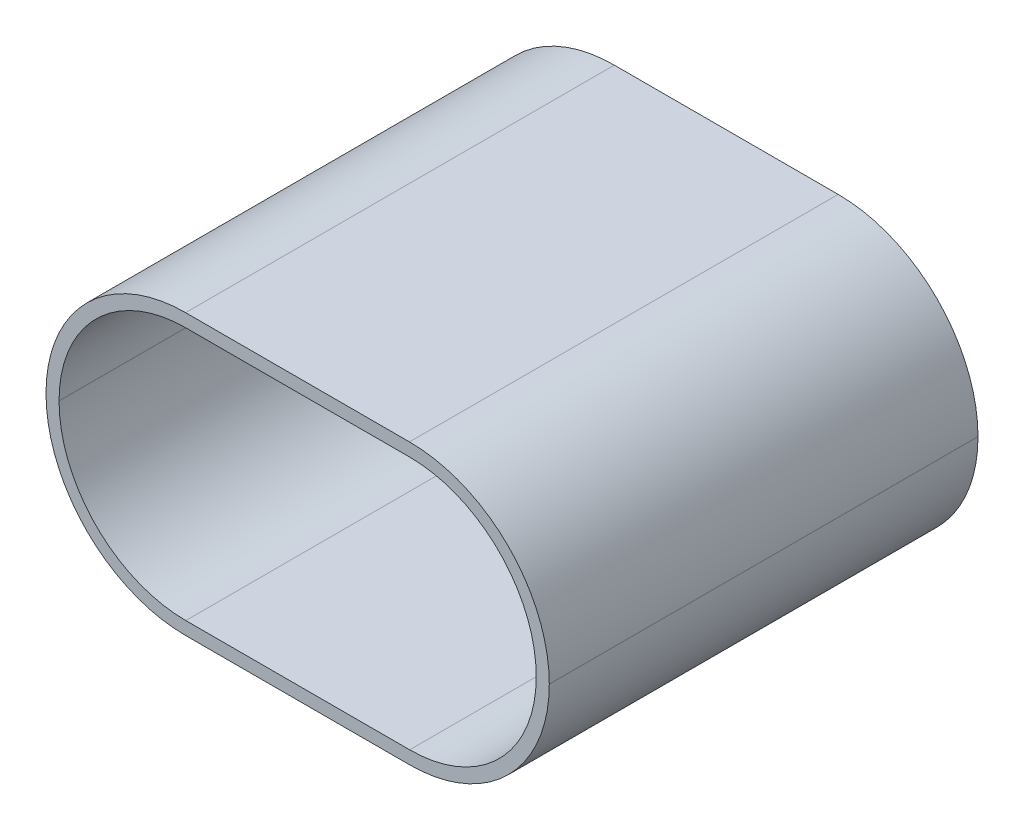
from build123d import *

# Parameters (mm, degrees)
EXTRUSION1_DEPTH        = 24
ENL_V_MAT_EXTRU_1_DEPTH = 1
EXTRUSION2_START        = -1
EXTRUSION2_DEPTH        = 1


with BuildPart() as part:
    # Esquisse1 → Extrusion1 (new body)
    with BuildSketch(Plane.XY):
        with BuildLine():
            Line((-8.829098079, -21.6), (3.180901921, -21.6))
            ThreePointArc((3.180901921, -21.6), (8.477131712, -19.406229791), (10.670901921, -14.11))
            Line((10.670901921, -14.11), (10.670901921, -14.1))
            ThreePointArc((10.670901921, -14.1), (8.47420278, -8.796699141), (3.170901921, -6.6))
            Line((3.170901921, -6.6), (-8.839098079, -6.6))
            ThreePointArc((-8.839098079, -6.6), (-14.13532787, -8.793770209), (-16.329098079, -14.09))
            Line((-16.329098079, -14.09), (-16.329098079, -14.1))
            ThreePointArc((-16.329098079, -14.1), (-14.132398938, -19.403300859), (-8.829098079, -21.6))
        make_face()
        with BuildLine():
            Line((3.170901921, -7.3), (-8.839098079, -7.3))
            ThreePointArc((-8.839098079, -7.3), (-13.640353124, -9.288744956), (-15.629098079, -14.09))
            Line((-15.629098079, -14.09), (-15.629098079, -14.1))
            ThreePointArc((-15.629098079, -14.1), (-13.637424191, -18.908326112), (-8.829098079, -20.9))
            Line((-8.829098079, -20.9), (3.180901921, -20.9))
            ThreePointArc((3.180901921, -20.9), (7.982156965, -18.911255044), (9.970901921, -14.11))
            Line((9.970901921, -14.11), (9.970901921, -14.1))
            ThreePointArc((9.970901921, -14.1), (7.979228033, -9.291673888), (3.170901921, -7.3))
        make_face(mode=Mode.SUBTRACT)
    extrude(amount=-EXTRUSION1_DEPTH)

    # Esquisse2 → Enl_v. mat.-Extru.1 (cut)
    with BuildSketch(Plane.XY):
        with BuildLine():
            Line((-8.829098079, -21.6), (3.180901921, -21.6))
            ThreePointArc((3.180901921, -21.6), (8.477131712, -19.406229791), (10.670901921, -14.11))
            Line((10.670901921, -14.11), (10.670901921, -14.1))
            ThreePointArc((10.670901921, -14.1), (8.47420278, -8.796699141), (3.170901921, -6.6))
            Line((3.170901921, -6.6), (-8.839098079, -6.6))
            ThreePointArc((-8.839098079, -6.6), (-14.13532787, -8.793770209), (-16.329098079, -14.09))
            Line((-16.329098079, -14.09), (-16.329098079, -14.1))
            ThreePointArc((-16.329098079, -14.1), (-14.132398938, -19.403300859), (-8.829098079, -21.6))
        make_face()
    extrude(amount=-ENL_V_MAT_EXTRU_1_DEPTH, mode=Mode.SUBTRACT)

    # Esquisse3 → Extrusion2 (add)
    with BuildSketch(Plane(origin=(0, 0, -24), x_dir=(-1, 0, 0), z_dir=(0, 0, -1)).offset(EXTRUSION2_START)):
        with BuildLine():
            Line((16.329098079, -14.1), (16.329098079, -14.09))
            ThreePointArc((16.329098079, -14.09), (14.13532787, -8.793770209), (8.839098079, -6.6))
            Line((8.839098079, -6.6), (-3.170901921, -6.6))
            ThreePointArc((-3.170901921, -6.6), (-8.47420278, -8.796699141), (-10.670901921, -14.1))
            Line((-10.670901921, -14.1), (-10.670901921, -14.11))
            ThreePointArc((-10.670901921, -14.11), (-8.477131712, -19.406229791), (-3.180901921, -21.6))
            Line((-3.180901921, -21.6), (8.829098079, -21.6))
            ThreePointArc((8.829098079, -21.6), (14.132398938, -19.403300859), (16.329098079, -14.1))
        make_face()
        with BuildLine():
            Line((8.839098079, -9.1), (-3.170901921, -9.1))
            ThreePointArc((-3.170901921, -9.1), (-6.706435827, -10.564466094), (-8.170901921, -14.1))
            Line((-8.170901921, -14.1), (-8.170901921, -14.11))
            ThreePointArc((-8.170901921, -14.11), (-6.709364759, -17.638462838), (-3.180901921, -19.1))
            Line((-3.180901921, -19.1), (8.829098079, -19.1))
            ThreePointArc((8.829098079, -19.1), (12.364631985, -17.635533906), (13.829098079, -14.1))
            Line((13.829098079, -14.1), (13.829098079, -14.09))
            ThreePointArc((13.829098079, -14.09), (12.367560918, -10.561537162), (8.839098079, -9.1))
        make_face(mode=Mode.SUBTRACT)
    extrude(amount=EXTRUSION2_DEPTH)


solid = part.part
